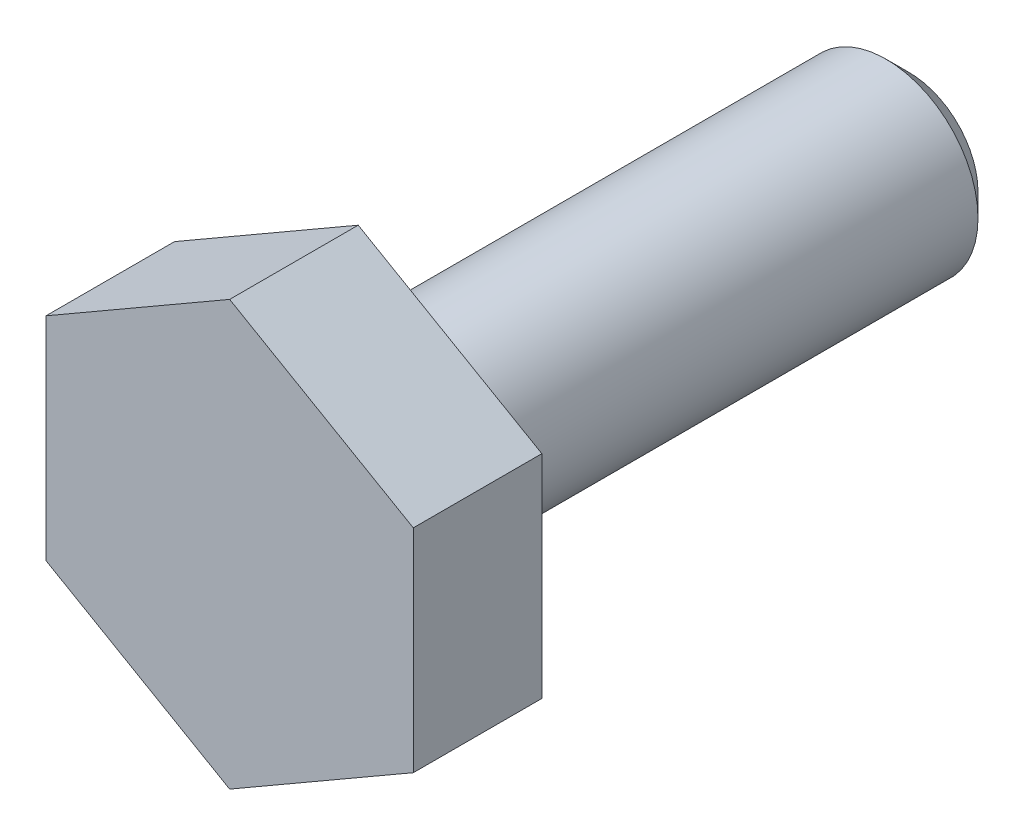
ISO-10303-21;
HEADER;
FILE_DESCRIPTION(('STEP AP214'),'2;1');
FILE_NAME('part.step','',(''),(''),'','','');
FILE_SCHEMA(('AUTOMOTIVE_DESIGN { 1 0 10303 214 1 1 1 1 }'));
ENDSEC;
DATA;
#1=APPLICATION_CONTEXT('core data for automotive mechanical design processes');
#2=APPLICATION_PROTOCOL_DEFINITION('international standard','automotive_design',2000,#1);
#3=PRODUCT_CONTEXT('',#1,'mechanical');
#4=PRODUCT('Part','Part','',(#3));
#5=PRODUCT_RELATED_PRODUCT_CATEGORY('part','',(#4));
#6=PRODUCT_DEFINITION_FORMATION('','',#4);
#7=PRODUCT_DEFINITION_CONTEXT('part definition',#1,'design');
#8=PRODUCT_DEFINITION('design','',#6,#7);
#9=PRODUCT_DEFINITION_SHAPE('','',#8);
#10=(LENGTH_UNIT() NAMED_UNIT(*) SI_UNIT(.MILLI.,.METRE.));
#11=(NAMED_UNIT(*) PLANE_ANGLE_UNIT() SI_UNIT($,.RADIAN.));
#12=(NAMED_UNIT(*) SI_UNIT($,.STERADIAN.) SOLID_ANGLE_UNIT());
#13=UNCERTAINTY_MEASURE_WITH_UNIT(LENGTH_MEASURE(1.E-05),#10,'distance_accuracy_value','');
#14=(GEOMETRIC_REPRESENTATION_CONTEXT(3) GLOBAL_UNCERTAINTY_ASSIGNED_CONTEXT((#13)) GLOBAL_UNIT_ASSIGNED_CONTEXT((#10,
#11,#12)) REPRESENTATION_CONTEXT('',''));
#15=CARTESIAN_POINT('',(0.,0.,0.));
#16=DIRECTION('',(0.,0.,1.));
#17=DIRECTION('',(1.,0.,0.));
#18=AXIS2_PLACEMENT_3D('',#15,#16,#17);
#19=CARTESIAN_POINT('',(0.,-2.3094010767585,1.4));
#20=DIRECTION('',(-0.5,0.866025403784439,0.));
#21=DIRECTION('',(-0.866025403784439,-0.5,0.));
#22=AXIS2_PLACEMENT_3D('',#19,#20,#21);
#23=PLANE('',#22);
#24=DIRECTION('',(0.866025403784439,0.5,0.));
#25=VECTOR('',#24,1.);
#26=CARTESIAN_POINT('',(0.,-2.3094010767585,0.));
#27=LINE('',#26,#25);
#28=CARTESIAN_POINT('',(0.,-2.3094010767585,0.));
#29=VERTEX_POINT('',#28);
#30=CARTESIAN_POINT('',(2.,-1.15470053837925,0.));
#31=VERTEX_POINT('',#30);
#32=EDGE_CURVE('E125',#29,#31,#27,.T.);
#33=ORIENTED_EDGE('',*,*,#32,.T.);
#34=DIRECTION('',(0.,0.,-1.));
#35=VECTOR('',#34,1.);
#36=CARTESIAN_POINT('',(2.,-1.15470053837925,1.4));
#37=LINE('',#36,#35);
#38=CARTESIAN_POINT('',(2.,-1.15470053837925,1.4));
#39=VERTEX_POINT('',#38);
#40=EDGE_CURVE('E143',#39,#31,#37,.T.);
#41=ORIENTED_EDGE('',*,*,#40,.F.);
#42=DIRECTION('',(0.866025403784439,0.5,0.));
#43=VECTOR('',#42,1.);
#44=CARTESIAN_POINT('',(0.,-2.3094010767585,1.4));
#45=LINE('',#44,#43);
#46=CARTESIAN_POINT('',(0.,-2.3094010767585,1.4));
#47=VERTEX_POINT('',#46);
#48=EDGE_CURVE('E136',#47,#39,#45,.T.);
#49=ORIENTED_EDGE('',*,*,#48,.F.);
#50=DIRECTION('',(0.,0.,-1.));
#51=VECTOR('',#50,1.);
#52=CARTESIAN_POINT('',(0.,-2.3094010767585,1.4));
#53=LINE('',#52,#51);
#54=EDGE_CURVE('E121',#47,#29,#53,.T.);
#55=ORIENTED_EDGE('',*,*,#54,.T.);
#56=EDGE_LOOP('',(#33,#41,#49,#55));
#57=FACE_BOUND('',#56,.T.);
#58=ADVANCED_FACE('F39',(#57),#23,.F.);
#59=CARTESIAN_POINT('',(2.,-1.15470053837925,1.4));
#60=DIRECTION('',(-1.,0.,0.));
#61=DIRECTION('',(0.,-1.,0.));
#62=AXIS2_PLACEMENT_3D('',#59,#60,#61);
#63=PLANE('',#62);
#64=DIRECTION('',(0.,1.,0.));
#65=VECTOR('',#64,1.);
#66=CARTESIAN_POINT('',(2.,-1.15470053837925,0.));
#67=LINE('',#66,#65);
#68=CARTESIAN_POINT('',(2.,1.15470053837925,0.));
#69=VERTEX_POINT('',#68);
#70=EDGE_CURVE('E128',#31,#69,#67,.T.);
#71=ORIENTED_EDGE('',*,*,#70,.T.);
#72=DIRECTION('',(0.,0.,-1.));
#73=VECTOR('',#72,1.);
#74=CARTESIAN_POINT('',(2.,1.15470053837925,1.4));
#75=LINE('',#74,#73);
#76=CARTESIAN_POINT('',(2.,1.15470053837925,1.4));
#77=VERTEX_POINT('',#76);
#78=EDGE_CURVE('E140',#77,#69,#75,.T.);
#79=ORIENTED_EDGE('',*,*,#78,.F.);
#80=DIRECTION('',(0.,1.,0.));
#81=VECTOR('',#80,1.);
#82=CARTESIAN_POINT('',(2.,-1.15470053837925,1.4));
#83=LINE('',#82,#81);
#84=EDGE_CURVE('E94',#39,#77,#83,.T.);
#85=ORIENTED_EDGE('',*,*,#84,.F.);
#86=ORIENTED_EDGE('',*,*,#40,.T.);
#87=EDGE_LOOP('',(#71,#79,#85,#86));
#88=FACE_BOUND('',#87,.T.);
#89=ADVANCED_FACE('F160',(#88),#63,.F.);
#90=CARTESIAN_POINT('',(2.,1.15470053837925,1.4));
#91=DIRECTION('',(-0.5,-0.866025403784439,0.));
#92=DIRECTION('',(0.866025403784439,-0.5,0.));
#93=AXIS2_PLACEMENT_3D('',#90,#91,#92);
#94=PLANE('',#93);
#95=DIRECTION('',(-0.866025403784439,0.5,0.));
#96=VECTOR('',#95,1.);
#97=CARTESIAN_POINT('',(2.,1.15470053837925,0.));
#98=LINE('',#97,#96);
#99=CARTESIAN_POINT('',(0.,2.3094010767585,0.));
#100=VERTEX_POINT('',#99);
#101=EDGE_CURVE('E131',#69,#100,#98,.T.);
#102=ORIENTED_EDGE('',*,*,#101,.T.);
#103=DIRECTION('',(0.,0.,-1.));
#104=VECTOR('',#103,1.);
#105=CARTESIAN_POINT('',(0.,2.3094010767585,1.4));
#106=LINE('',#105,#104);
#107=CARTESIAN_POINT('',(0.,2.3094010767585,1.4));
#108=VERTEX_POINT('',#107);
#109=EDGE_CURVE('E116',#108,#100,#106,.T.);
#110=ORIENTED_EDGE('',*,*,#109,.F.);
#111=DIRECTION('',(-0.866025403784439,0.5,0.));
#112=VECTOR('',#111,1.);
#113=CARTESIAN_POINT('',(2.,1.15470053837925,1.4));
#114=LINE('',#113,#112);
#115=EDGE_CURVE('E107',#77,#108,#114,.T.);
#116=ORIENTED_EDGE('',*,*,#115,.F.);
#117=ORIENTED_EDGE('',*,*,#78,.T.);
#118=EDGE_LOOP('',(#102,#110,#116,#117));
#119=FACE_BOUND('',#118,.T.);
#120=ADVANCED_FACE('F165',(#119),#94,.F.);
#121=CARTESIAN_POINT('',(0.,2.3094010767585,1.4));
#122=DIRECTION('',(0.5,-0.866025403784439,0.));
#123=DIRECTION('',(0.866025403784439,0.5,0.));
#124=AXIS2_PLACEMENT_3D('',#121,#122,#123);
#125=PLANE('',#124);
#126=DIRECTION('',(-0.866025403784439,-0.5,0.));
#127=VECTOR('',#126,1.);
#128=CARTESIAN_POINT('',(0.,2.3094010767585,0.));
#129=LINE('',#128,#127);
#130=CARTESIAN_POINT('',(-2.,1.15470053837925,0.));
#131=VERTEX_POINT('',#130);
#132=EDGE_CURVE('E115',#100,#131,#129,.T.);
#133=ORIENTED_EDGE('',*,*,#132,.T.);
#134=DIRECTION('',(0.,0.,-1.));
#135=VECTOR('',#134,1.);
#136=CARTESIAN_POINT('',(-2.,1.15470053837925,1.4));
#137=LINE('',#136,#135);
#138=CARTESIAN_POINT('',(-2.,1.15470053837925,1.4));
#139=VERTEX_POINT('',#138);
#140=EDGE_CURVE('E112',#139,#131,#137,.T.);
#141=ORIENTED_EDGE('',*,*,#140,.F.);
#142=DIRECTION('',(-0.866025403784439,-0.5,0.));
#143=VECTOR('',#142,1.);
#144=CARTESIAN_POINT('',(0.,2.3094010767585,1.4));
#145=LINE('',#144,#143);
#146=EDGE_CURVE('E101',#108,#139,#145,.T.);
#147=ORIENTED_EDGE('',*,*,#146,.F.);
#148=ORIENTED_EDGE('',*,*,#109,.T.);
#149=EDGE_LOOP('',(#133,#141,#147,#148));
#150=FACE_BOUND('',#149,.T.);
#151=ADVANCED_FACE('F113',(#150),#125,.F.);
#152=CARTESIAN_POINT('',(-2.,1.15470053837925,1.4));
#153=DIRECTION('',(1.,0.,0.));
#154=DIRECTION('',(0.,1.,0.));
#155=AXIS2_PLACEMENT_3D('',#152,#153,#154);
#156=PLANE('',#155);
#157=DIRECTION('',(0.,-1.,0.));
#158=VECTOR('',#157,1.);
#159=CARTESIAN_POINT('',(-2.,1.15470053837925,0.));
#160=LINE('',#159,#158);
#161=CARTESIAN_POINT('',(-2.,-1.15470053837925,0.));
#162=VERTEX_POINT('',#161);
#163=EDGE_CURVE('E79',#131,#162,#160,.T.);
#164=ORIENTED_EDGE('',*,*,#163,.T.);
#165=DIRECTION('',(0.,0.,-1.));
#166=VECTOR('',#165,1.);
#167=CARTESIAN_POINT('',(-2.,-1.15470053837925,1.4));
#168=LINE('',#167,#166);
#169=CARTESIAN_POINT('',(-2.,-1.15470053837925,1.4));
#170=VERTEX_POINT('',#169);
#171=EDGE_CURVE('E117',#170,#162,#168,.T.);
#172=ORIENTED_EDGE('',*,*,#171,.F.);
#173=DIRECTION('',(0.,-1.,0.));
#174=VECTOR('',#173,1.);
#175=CARTESIAN_POINT('',(-2.,1.15470053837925,1.4));
#176=LINE('',#175,#174);
#177=EDGE_CURVE('E105',#139,#170,#176,.T.);
#178=ORIENTED_EDGE('',*,*,#177,.F.);
#179=ORIENTED_EDGE('',*,*,#140,.T.);
#180=EDGE_LOOP('',(#164,#172,#178,#179));
#181=FACE_BOUND('',#180,.T.);
#182=ADVANCED_FACE('F119',(#181),#156,.F.);
#183=CARTESIAN_POINT('',(-2.,-1.15470053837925,1.4));
#184=DIRECTION('',(0.5,0.866025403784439,0.));
#185=DIRECTION('',(-0.866025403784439,0.5,0.));
#186=AXIS2_PLACEMENT_3D('',#183,#184,#185);
#187=PLANE('',#186);
#188=DIRECTION('',(0.866025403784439,-0.5,0.));
#189=VECTOR('',#188,1.);
#190=CARTESIAN_POINT('',(-2.,-1.15470053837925,0.));
#191=LINE('',#190,#189);
#192=EDGE_CURVE('E85',#162,#29,#191,.T.);
#193=ORIENTED_EDGE('',*,*,#192,.T.);
#194=ORIENTED_EDGE('',*,*,#54,.F.);
#195=DIRECTION('',(0.866025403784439,-0.5,0.));
#196=VECTOR('',#195,1.);
#197=CARTESIAN_POINT('',(-2.,-1.15470053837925,1.4));
#198=LINE('',#197,#196);
#199=EDGE_CURVE('E56',#170,#47,#198,.T.);
#200=ORIENTED_EDGE('',*,*,#199,.F.);
#201=ORIENTED_EDGE('',*,*,#171,.T.);
#202=EDGE_LOOP('',(#193,#194,#200,#201));
#203=FACE_BOUND('',#202,.T.);
#204=ADVANCED_FACE('F175',(#203),#187,.F.);
#205=CARTESIAN_POINT('',(0.,0.,1.4));
#206=DIRECTION('',(0.,0.,1.));
#207=DIRECTION('',(1.,0.,0.));
#208=AXIS2_PLACEMENT_3D('',#205,#206,#207);
#209=PLANE('',#208);
#210=ORIENTED_EDGE('',*,*,#48,.T.);
#211=ORIENTED_EDGE('',*,*,#84,.T.);
#212=ORIENTED_EDGE('',*,*,#115,.T.);
#213=ORIENTED_EDGE('',*,*,#146,.T.);
#214=ORIENTED_EDGE('',*,*,#177,.T.);
#215=ORIENTED_EDGE('',*,*,#199,.T.);
#216=EDGE_LOOP('',(#210,#211,#212,#213,#214,#215));
#217=FACE_BOUND('',#216,.T.);
#218=ADVANCED_FACE('F103',(#217),#209,.T.);
#219=CARTESIAN_POINT('',(0.,0.,0.));
#220=DIRECTION('',(0.,0.,1.));
#221=DIRECTION('',(1.,0.,0.));
#222=AXIS2_PLACEMENT_3D('',#219,#220,#221);
#223=PLANE('',#222);
#224=CARTESIAN_POINT('',(0.,0.,0.));
#225=DIRECTION('',(0.,0.,1.));
#226=DIRECTION('',(1.,0.,0.));
#227=AXIS2_PLACEMENT_3D('',#224,#225,#226);
#228=CIRCLE('',#227,1.);
#229=CARTESIAN_POINT('',(1.,0.,0.));
#230=VERTEX_POINT('',#229);
#231=EDGE_CURVE('E129',#230,#230,#228,.T.);
#232=ORIENTED_EDGE('',*,*,#231,.T.);
#233=EDGE_LOOP('',(#232));
#234=FACE_BOUND('',#233,.T.);
#235=ORIENTED_EDGE('',*,*,#32,.F.);
#236=ORIENTED_EDGE('',*,*,#192,.F.);
#237=ORIENTED_EDGE('',*,*,#163,.F.);
#238=ORIENTED_EDGE('',*,*,#132,.F.);
#239=ORIENTED_EDGE('',*,*,#101,.F.);
#240=ORIENTED_EDGE('',*,*,#70,.F.);
#241=EDGE_LOOP('',(#235,#236,#237,#238,#239,#240));
#242=FACE_BOUND('',#241,.T.);
#243=ADVANCED_FACE('F178',(#234,#242),#223,.F.);
#244=CARTESIAN_POINT('',(0.,0.,-6.));
#245=DIRECTION('',(0.,0.,1.));
#246=DIRECTION('',(1.,0.,0.));
#247=AXIS2_PLACEMENT_3D('',#244,#245,#246);
#248=CYLINDRICAL_SURFACE('',#247,1.);
#249=CARTESIAN_POINT('',(0.,0.,-5.75));
#250=DIRECTION('',(0.,0.,1.));
#251=DIRECTION('',(1.,0.,0.));
#252=AXIS2_PLACEMENT_3D('',#249,#250,#251);
#253=CIRCLE('',#252,1.);
#254=CARTESIAN_POINT('',(1.,0.,-5.75));
#255=VERTEX_POINT('',#254);
#256=EDGE_CURVE('E48',#255,#255,#253,.T.);
#257=ORIENTED_EDGE('',*,*,#256,.T.);
#258=EDGE_LOOP('',(#257));
#259=FACE_BOUND('',#258,.T.);
#260=ORIENTED_EDGE('',*,*,#231,.F.);
#261=EDGE_LOOP('',(#260));
#262=FACE_BOUND('',#261,.T.);
#263=ADVANCED_FACE('F147',(#259,#262),#248,.T.);
#264=CARTESIAN_POINT('',(0.,0.,-6.));
#265=DIRECTION('',(0.,0.,1.));
#266=DIRECTION('',(1.,0.,0.));
#267=AXIS2_PLACEMENT_3D('',#264,#265,#266);
#268=PLANE('',#267);
#269=CARTESIAN_POINT('',(0.,0.,-6.));
#270=DIRECTION('',(0.,0.,1.));
#271=DIRECTION('',(1.,0.,0.));
#272=AXIS2_PLACEMENT_3D('',#269,#270,#271);
#273=CIRCLE('',#272,0.749999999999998);
#274=CARTESIAN_POINT('',(0.749999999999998,0.,-6.));
#275=VERTEX_POINT('',#274);
#276=EDGE_CURVE('E11',#275,#275,#273,.F.);
#277=ORIENTED_EDGE('',*,*,#276,.T.);
#278=EDGE_LOOP('',(#277));
#279=FACE_BOUND('',#278,.T.);
#280=ADVANCED_FACE('F151',(#279),#268,.F.);
#281=CARTESIAN_POINT('',(0.,0.,-5.75));
#282=DIRECTION('',(0.,0.,1.));
#283=DIRECTION('',(1.,0.,0.));
#284=AXIS2_PLACEMENT_3D('',#281,#282,#283);
#285=CONICAL_SURFACE('',#284,1.,0.78539816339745);
#286=ORIENTED_EDGE('',*,*,#276,.F.);
#287=EDGE_LOOP('',(#286));
#288=FACE_BOUND('',#287,.T.);
#289=ORIENTED_EDGE('',*,*,#256,.F.);
#290=EDGE_LOOP('',(#289));
#291=FACE_BOUND('',#290,.T.);
#292=ADVANCED_FACE('F41',(#288,#291),#285,.T.);
#293=CLOSED_SHELL('',(#58,#89,#120,#151,#182,#204,#218,#243,#263,#280,#292));
#294=MANIFOLD_SOLID_BREP('B2',#293);
#295=ADVANCED_BREP_SHAPE_REPRESENTATION('',(#18,#294),#14);
#296=SHAPE_DEFINITION_REPRESENTATION(#9,#295);
ENDSEC;
END-ISO-10303-21;
